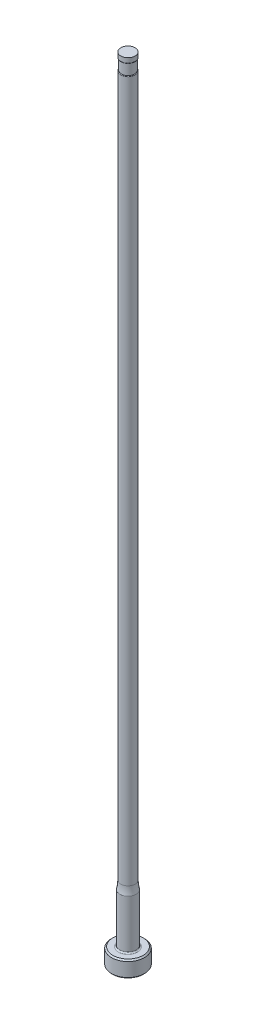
ISO-10303-21;
HEADER;
FILE_DESCRIPTION(('STEP AP214'),'2;1');
FILE_NAME('part.step','',(''),(''),'','','');
FILE_SCHEMA(('AUTOMOTIVE_DESIGN { 1 0 10303 214 1 1 1 1 }'));
ENDSEC;
DATA;
#1=APPLICATION_CONTEXT('core data for automotive mechanical design processes');
#2=APPLICATION_PROTOCOL_DEFINITION('international standard','automotive_design',2000,#1);
#3=PRODUCT_CONTEXT('',#1,'mechanical');
#4=PRODUCT('Part','Part','',(#3));
#5=PRODUCT_RELATED_PRODUCT_CATEGORY('part','',(#4));
#6=PRODUCT_DEFINITION_FORMATION('','',#4);
#7=PRODUCT_DEFINITION_CONTEXT('part definition',#1,'design');
#8=PRODUCT_DEFINITION('design','',#6,#7);
#9=PRODUCT_DEFINITION_SHAPE('','',#8);
#10=(LENGTH_UNIT() NAMED_UNIT(*) SI_UNIT(.MILLI.,.METRE.));
#11=(NAMED_UNIT(*) PLANE_ANGLE_UNIT() SI_UNIT($,.RADIAN.));
#12=(NAMED_UNIT(*) SI_UNIT($,.STERADIAN.) SOLID_ANGLE_UNIT());
#13=UNCERTAINTY_MEASURE_WITH_UNIT(LENGTH_MEASURE(1.E-05),#10,'distance_accuracy_value','');
#14=(GEOMETRIC_REPRESENTATION_CONTEXT(3) GLOBAL_UNCERTAINTY_ASSIGNED_CONTEXT((#13)) GLOBAL_UNIT_ASSIGNED_CONTEXT((#10,
#11,#12)) REPRESENTATION_CONTEXT('',''));
#15=CARTESIAN_POINT('',(0.,0.,0.));
#16=DIRECTION('',(0.,0.,1.));
#17=DIRECTION('',(1.,0.,0.));
#18=AXIS2_PLACEMENT_3D('',#15,#16,#17);
#19=CARTESIAN_POINT('',(0.,259.958771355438,0.));
#20=DIRECTION('',(0.,1.,0.));
#21=DIRECTION('',(0.,0.,1.));
#22=AXIS2_PLACEMENT_3D('',#19,#20,#21);
#23=CYLINDRICAL_SURFACE('',#22,1.38810999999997);
#24=DIRECTION('',(0.,1.,0.));
#25=VECTOR('',#24,1.);
#26=CARTESIAN_POINT('',(-1.28650999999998,259.958771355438,-0.521288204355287));
#27=LINE('',#26,#25);
#28=CARTESIAN_POINT('',(-1.28650999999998,149.227565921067,-0.521288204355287));
#29=VERTEX_POINT('',#28);
#30=CARTESIAN_POINT('',(-1.28650999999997,112.268,-0.521288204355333));
#31=VERTEX_POINT('',#30);
#32=EDGE_CURVE('E66',#29,#31,#27,.F.);
#33=ORIENTED_EDGE('',*,*,#32,.F.);
#34=CARTESIAN_POINT('',(0.,149.227565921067,0.));
#35=DIRECTION('',(0.,1.,0.));
#36=DIRECTION('',(0.,0.,1.));
#37=AXIS2_PLACEMENT_3D('',#34,#35,#36);
#38=CIRCLE('',#37,1.38810999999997);
#39=CARTESIAN_POINT('',(-1.28650999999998,149.227565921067,0.521288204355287));
#40=VERTEX_POINT('',#39);
#41=EDGE_CURVE('E44',#29,#40,#38,.F.);
#42=ORIENTED_EDGE('',*,*,#41,.T.);
#43=DIRECTION('',(0.,1.,0.));
#44=VECTOR('',#43,1.);
#45=CARTESIAN_POINT('',(-1.28650999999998,259.958771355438,0.521288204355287));
#46=LINE('',#45,#44);
#47=CARTESIAN_POINT('',(-1.28650999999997,112.268,0.521288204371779));
#48=VERTEX_POINT('',#47);
#49=EDGE_CURVE('E72',#48,#40,#46,.T.);
#50=ORIENTED_EDGE('',*,*,#49,.F.);
#51=CARTESIAN_POINT('',(-1.28650999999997,112.268,-0.521288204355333));
#52=CARTESIAN_POINT('',(-1.28650942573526,112.242928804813,-0.521284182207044));
#53=CARTESIAN_POINT('',(-1.28680726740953,112.217865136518,-0.520555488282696));
#54=CARTESIAN_POINT('',(-1.28799191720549,112.167826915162,-0.517619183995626));
#55=CARTESIAN_POINT('',(-1.28887900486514,112.142852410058,-0.515410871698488));
#56=CARTESIAN_POINT('',(-1.29243982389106,112.067619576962,-0.506452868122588));
#57=CARTESIAN_POINT('',(-1.29601290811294,112.017650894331,-0.49736839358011));
#58=CARTESIAN_POINT('',(-1.30530992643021,111.919479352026,-0.472434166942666));
#59=CARTESIAN_POINT('',(-1.31103961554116,111.871281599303,-0.456566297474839));
#60=CARTESIAN_POINT('',(-1.32412375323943,111.778513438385,-0.417110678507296));
#61=CARTESIAN_POINT('',(-1.33146964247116,111.733925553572,-0.393563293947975));
#62=CARTESIAN_POINT('',(-1.34350828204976,111.668593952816,-0.349438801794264));
#63=CARTESIAN_POINT('',(-1.34799903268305,111.645780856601,-0.331865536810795));
#64=CARTESIAN_POINT('',(-1.35686421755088,111.60296367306,-0.29352417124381));
#65=CARTESIAN_POINT('',(-1.36123876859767,111.582956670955,-0.272759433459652));
#66=CARTESIAN_POINT('',(-1.36869665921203,111.550112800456,-0.232084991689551));
#67=CARTESIAN_POINT('',(-1.37186978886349,111.536633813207,-0.212714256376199));
#68=CARTESIAN_POINT('',(-1.37757131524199,111.51295318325,-0.171955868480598));
#69=CARTESIAN_POINT('',(-1.38010004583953,111.502749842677,-0.150569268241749));
#70=CARTESIAN_POINT('',(-1.38424028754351,111.486264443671,-0.105984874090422));
#71=CARTESIAN_POINT('',(-1.38584269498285,111.480021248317,-0.0827715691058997));
#72=CARTESIAN_POINT('',(-1.3878558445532,111.472203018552,-0.0355242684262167));
#73=CARTESIAN_POINT('',(-1.38826785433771,111.470623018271,-0.0114911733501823));
#74=CARTESIAN_POINT('',(-1.38787374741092,111.472145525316,0.0326639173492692));
#75=CARTESIAN_POINT('',(-1.38724652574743,111.474560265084,0.0528147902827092));
#76=CARTESIAN_POINT('',(-1.38517272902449,111.482639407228,0.0924056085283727));
#77=CARTESIAN_POINT('',(-1.38372605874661,111.488304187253,0.111845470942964));
#78=CARTESIAN_POINT('',(-1.38015682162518,111.502532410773,0.149590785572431));
#79=CARTESIAN_POINT('',(-1.37803307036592,111.511100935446,0.167894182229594));
#80=CARTESIAN_POINT('',(-1.37329208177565,111.530682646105,0.203060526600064));
#81=CARTESIAN_POINT('',(-1.3706746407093,111.541696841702,0.219922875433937));
#82=CARTESIAN_POINT('',(-1.36363743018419,111.572179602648,0.260714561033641));
#83=CARTESIAN_POINT('',(-1.35900359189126,111.593015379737,0.283587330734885));
#84=CARTESIAN_POINT('',(-1.34954115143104,111.638071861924,0.325660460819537));
#85=CARTESIAN_POINT('',(-1.34471211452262,111.662300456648,0.344852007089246));
#86=CARTESIAN_POINT('',(-1.3331073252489,111.724742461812,0.387781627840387));
#87=CARTESIAN_POINT('',(-1.32644843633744,111.764293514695,0.409600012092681));
#88=CARTESIAN_POINT('',(-1.31433631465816,111.846492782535,0.446935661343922));
#89=CARTESIAN_POINT('',(-1.3088875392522,111.889151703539,0.462429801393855));
#90=CARTESIAN_POINT('',(-1.29848168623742,111.987173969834,0.491004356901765));
#91=CARTESIAN_POINT('',(-1.29398787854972,112.043047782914,0.50251359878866));
#92=CARTESIAN_POINT('',(-1.2895011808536,112.127377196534,0.513856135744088));
#93=CARTESIAN_POINT('',(-1.28838136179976,112.155428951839,0.516650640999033));
#94=CARTESIAN_POINT('',(-1.28688584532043,112.211649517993,0.520362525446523));
#95=CARTESIAN_POINT('',(-1.28650943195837,112.239818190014,0.521281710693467));
#96=CARTESIAN_POINT('',(-1.28650999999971,112.267999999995,0.521288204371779));
#97=B_SPLINE_CURVE_WITH_KNOTS('',3,(#51,#52,#53,#54,#55,#56,#57,#58,#59,#60,#61,#62,#63,#64,#65,
#66,#67,#68,#69,#70,#71,#72,#73,#74,#75,#76,#77,#78,#79,#80,#81,#82,#83,#84,#85,#86,#87,#88,#89,
#90,#91,#92,#93,#94,#95,#96),.UNSPECIFIED.,.F.,.F.,(4,2,2,2,2,2,2,2,2,2,2,2,2,2,2,2,2,2,2,2,2,2,
4),(0.,0.0751855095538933,0.15040671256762,0.30263293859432,0.455268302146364,0.607113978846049,
0.694309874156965,0.781414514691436,0.852578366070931,0.923705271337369,0.99551980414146,
1.06725783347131,1.12787752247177,1.18850425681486,1.2492376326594,1.30999612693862,
1.40332110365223,1.49686681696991,1.63308593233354,1.76979877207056,1.94068119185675,
2.02526314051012,2.10976359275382),.UNSPECIFIED.);
#98=EDGE_CURVE('E74',#31,#48,#97,.T.);
#99=ORIENTED_EDGE('',*,*,#98,.F.);
#100=EDGE_LOOP('',(#33,#42,#50,#99));
#101=FACE_BOUND('',#100,.T.);
#102=CARTESIAN_POINT('',(0.,14.2787642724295,0.));
#103=DIRECTION('',(0.,1.,0.));
#104=DIRECTION('',(0.,0.,1.));
#105=AXIS2_PLACEMENT_3D('',#102,#103,#104);
#106=CIRCLE('',#105,1.38810999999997);
#107=CARTESIAN_POINT('',(0.,14.2787642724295,1.38810999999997));
#108=VERTEX_POINT('',#107);
#109=EDGE_CURVE('E95',#108,#108,#106,.T.);
#110=ORIENTED_EDGE('',*,*,#109,.T.);
#111=EDGE_LOOP('',(#110));
#112=FACE_BOUND('',#111,.T.);
#113=ADVANCED_FACE('F36',(#101,#112),#23,.T.);
#114=CARTESIAN_POINT('',(0.,14.2787642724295,0.));
#115=DIRECTION('',(0.,1.,0.));
#116=DIRECTION('',(0.,0.,1.));
#117=AXIS2_PLACEMENT_3D('',#114,#115,#116);
#118=TOROIDAL_SURFACE('',#117,7.73810999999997,6.35);
#119=CARTESIAN_POINT('',(0.,12.7,0.));
#120=DIRECTION('',(0.,1.,0.));
#121=DIRECTION('',(0.,0.,1.));
#122=AXIS2_PLACEMENT_3D('',#119,#120,#121);
#123=CIRCLE('',#122,1.58749999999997);
#124=CARTESIAN_POINT('',(0.,12.7,1.58749999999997));
#125=VERTEX_POINT('',#124);
#126=EDGE_CURVE('E92',#125,#125,#123,.T.);
#127=ORIENTED_EDGE('',*,*,#126,.T.);
#128=EDGE_LOOP('',(#127));
#129=FACE_BOUND('',#128,.T.);
#130=ORIENTED_EDGE('',*,*,#109,.F.);
#131=EDGE_LOOP('',(#130));
#132=FACE_BOUND('',#131,.T.);
#133=ADVANCED_FACE('F156',(#129,#132),#118,.F.);
#134=CARTESIAN_POINT('',(0.,259.958771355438,0.));
#135=DIRECTION('',(0.,1.,0.));
#136=DIRECTION('',(0.,0.,1.));
#137=AXIS2_PLACEMENT_3D('',#134,#135,#136);
#138=CYLINDRICAL_SURFACE('',#137,1.58749999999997);
#139=CARTESIAN_POINT('',(0.,3.42900000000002,0.));
#140=DIRECTION('',(0.,1.,0.));
#141=DIRECTION('',(0.,0.,1.));
#142=AXIS2_PLACEMENT_3D('',#139,#140,#141);
#143=CIRCLE('',#142,1.58749999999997);
#144=CARTESIAN_POINT('',(0.,3.42900000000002,1.58749999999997));
#145=VERTEX_POINT('',#144);
#146=EDGE_CURVE('E110',#145,#145,#143,.T.);
#147=ORIENTED_EDGE('',*,*,#146,.T.);
#148=EDGE_LOOP('',(#147));
#149=FACE_BOUND('',#148,.T.);
#150=ORIENTED_EDGE('',*,*,#126,.F.);
#151=EDGE_LOOP('',(#150));
#152=FACE_BOUND('',#151,.T.);
#153=ADVANCED_FACE('F153',(#149,#152),#138,.T.);
#154=CARTESIAN_POINT('',(-3.17499999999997,3.175,0.));
#155=DIRECTION('',(0.,1.,0.));
#156=DIRECTION('',(0.,0.,1.));
#157=AXIS2_PLACEMENT_3D('',#154,#155,#156);
#158=PLANE('',#157);
#159=CARTESIAN_POINT('',(0.,3.175,0.));
#160=DIRECTION('',(0.,1.,0.));
#161=DIRECTION('',(0.,0.,1.));
#162=AXIS2_PLACEMENT_3D('',#159,#160,#161);
#163=CIRCLE('',#162,1.84149999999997);
#164=CARTESIAN_POINT('',(0.,3.175,1.84149999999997));
#165=VERTEX_POINT('',#164);
#166=EDGE_CURVE('E78',#165,#165,#163,.F.);
#167=ORIENTED_EDGE('',*,*,#166,.T.);
#168=EDGE_LOOP('',(#167));
#169=FACE_BOUND('',#168,.T.);
#170=CARTESIAN_POINT('',(0.,3.175,0.));
#171=DIRECTION('',(0.,1.,0.));
#172=DIRECTION('',(0.,0.,1.));
#173=AXIS2_PLACEMENT_3D('',#170,#171,#172);
#174=CIRCLE('',#173,2.92099999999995);
#175=CARTESIAN_POINT('',(0.,3.175,2.92099999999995));
#176=VERTEX_POINT('',#175);
#177=EDGE_CURVE('E98',#176,#176,#174,.T.);
#178=ORIENTED_EDGE('',*,*,#177,.T.);
#179=EDGE_LOOP('',(#178));
#180=FACE_BOUND('',#179,.T.);
#181=ADVANCED_FACE('F149',(#169,#180),#158,.T.);
#182=CARTESIAN_POINT('',(0.,259.958771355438,0.));
#183=DIRECTION('',(0.,1.,0.));
#184=DIRECTION('',(0.,0.,1.));
#185=AXIS2_PLACEMENT_3D('',#182,#183,#184);
#186=CYLINDRICAL_SURFACE('',#185,3.17499999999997);
#187=CARTESIAN_POINT('',(0.,2.92100000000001,0.));
#188=DIRECTION('',(0.,1.,0.));
#189=DIRECTION('',(0.,0.,1.));
#190=AXIS2_PLACEMENT_3D('',#187,#188,#189);
#191=CIRCLE('',#190,3.17499999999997);
#192=CARTESIAN_POINT('',(0.,2.92100000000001,3.17499999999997));
#193=VERTEX_POINT('',#192);
#194=EDGE_CURVE('E104',#193,#193,#191,.F.);
#195=ORIENTED_EDGE('',*,*,#194,.T.);
#196=EDGE_LOOP('',(#195));
#197=FACE_BOUND('',#196,.T.);
#198=CARTESIAN_POINT('',(0.,0.254000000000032,0.));
#199=DIRECTION('',(0.,-1.,0.));
#200=DIRECTION('',(0.,0.,-1.));
#201=AXIS2_PLACEMENT_3D('',#198,#199,#200);
#202=CIRCLE('',#201,3.17499999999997);
#203=CARTESIAN_POINT('',(0.,0.254000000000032,-3.17499999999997));
#204=VERTEX_POINT('',#203);
#205=EDGE_CURVE('E101',#204,#204,#202,.F.);
#206=ORIENTED_EDGE('',*,*,#205,.T.);
#207=EDGE_LOOP('',(#206));
#208=FACE_BOUND('',#207,.T.);
#209=ADVANCED_FACE('F145',(#197,#208),#186,.T.);
#210=CARTESIAN_POINT('',(0.,0.,0.));
#211=DIRECTION('',(0.,-1.,0.));
#212=DIRECTION('',(0.,0.,-1.));
#213=AXIS2_PLACEMENT_3D('',#210,#211,#212);
#214=PLANE('',#213);
#215=CARTESIAN_POINT('',(0.,0.,0.));
#216=DIRECTION('',(0.,-1.,0.));
#217=DIRECTION('',(0.,0.,-1.));
#218=AXIS2_PLACEMENT_3D('',#215,#216,#217);
#219=CIRCLE('',#218,2.92099999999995);
#220=CARTESIAN_POINT('',(0.,0.,-2.92099999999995));
#221=VERTEX_POINT('',#220);
#222=EDGE_CURVE('E107',#221,#221,#219,.T.);
#223=ORIENTED_EDGE('',*,*,#222,.T.);
#224=EDGE_LOOP('',(#223));
#225=FACE_BOUND('',#224,.T.);
#226=ADVANCED_FACE('F141',(#225),#214,.T.);
#227=CARTESIAN_POINT('',(0.,3.17499999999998,0.));
#228=DIRECTION('',(0.,-1.,0.));
#229=DIRECTION('',(0.,0.,-1.));
#230=AXIS2_PLACEMENT_3D('',#227,#228,#229);
#231=CONICAL_SURFACE('',#230,2.92099999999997,0.7853981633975);
#232=ORIENTED_EDGE('',*,*,#194,.F.);
#233=EDGE_LOOP('',(#232));
#234=FACE_BOUND('',#233,.T.);
#235=ORIENTED_EDGE('',*,*,#177,.F.);
#236=EDGE_LOOP('',(#235));
#237=FACE_BOUND('',#236,.T.);
#238=ADVANCED_FACE('F144',(#234,#237),#231,.T.);
#239=CARTESIAN_POINT('',(0.,0.254000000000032,0.));
#240=DIRECTION('',(0.,1.,0.));
#241=DIRECTION('',(0.,0.,1.));
#242=AXIS2_PLACEMENT_3D('',#239,#240,#241);
#243=CONICAL_SURFACE('',#242,3.17499999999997,0.785398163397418);
#244=ORIENTED_EDGE('',*,*,#222,.F.);
#245=EDGE_LOOP('',(#244));
#246=FACE_BOUND('',#245,.T.);
#247=ORIENTED_EDGE('',*,*,#205,.F.);
#248=EDGE_LOOP('',(#247));
#249=FACE_BOUND('',#248,.T.);
#250=ADVANCED_FACE('F245',(#246,#249),#243,.T.);
#251=CARTESIAN_POINT('',(0.,3.42900000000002,0.));
#252=DIRECTION('',(0.,1.,0.));
#253=DIRECTION('',(0.,0.,1.));
#254=AXIS2_PLACEMENT_3D('',#251,#252,#253);
#255=TOROIDAL_SURFACE('',#254,1.84149999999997,0.254);
#256=ORIENTED_EDGE('',*,*,#166,.F.);
#257=EDGE_LOOP('',(#256));
#258=FACE_BOUND('',#257,.T.);
#259=ORIENTED_EDGE('',*,*,#146,.F.);
#260=EDGE_LOOP('',(#259));
#261=FACE_BOUND('',#260,.T.);
#262=ADVANCED_FACE('F139',(#258,#261),#255,.F.);
#263=CARTESIAN_POINT('',(0.,153.448281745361,0.));
#264=DIRECTION('',(0.,1.,0.));
#265=DIRECTION('',(0.,0.,1.));
#266=AXIS2_PLACEMENT_3D('',#263,#264,#265);
#267=CYLINDRICAL_SURFACE('',#266,1.28650999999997);
#268=CARTESIAN_POINT('',(0.,151.384,0.));
#269=DIRECTION('',(0.,1.,0.));
#270=DIRECTION('',(0.,0.,1.));
#271=AXIS2_PLACEMENT_3D('',#268,#269,#270);
#272=CIRCLE('',#271,1.28650999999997);
#273=CARTESIAN_POINT('',(0.,151.384,1.28650999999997));
#274=VERTEX_POINT('',#273);
#275=EDGE_CURVE('E71',#274,#274,#272,.T.);
#276=ORIENTED_EDGE('',*,*,#275,.F.);
#277=EDGE_LOOP('',(#276));
#278=FACE_BOUND('',#277,.T.);
#279=CARTESIAN_POINT('',(0.,149.352,0.));
#280=DIRECTION('',(0.,1.,0.));
#281=DIRECTION('',(0.,0.,1.));
#282=AXIS2_PLACEMENT_3D('',#279,#280,#281);
#283=CIRCLE('',#282,1.28650999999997);
#284=CARTESIAN_POINT('',(-1.28650999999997,149.352,0.));
#285=VERTEX_POINT('',#284);
#286=EDGE_CURVE('E89',#285,#285,#283,.T.);
#287=ORIENTED_EDGE('',*,*,#286,.T.);
#288=EDGE_LOOP('',(#287));
#289=FACE_BOUND('',#288,.T.);
#290=ADVANCED_FACE('F136',(#278,#289),#267,.T.);
#291=CARTESIAN_POINT('',(-1.28650999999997,150.368,-3.17499999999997));
#292=DIRECTION('',(1.,0.,0.));
#293=DIRECTION('',(0.,1.,0.));
#294=AXIS2_PLACEMENT_3D('',#291,#292,#293);
#295=PLANE('',#294);
#296=CARTESIAN_POINT('',(-1.28650999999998,149.227565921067,0.521288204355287));
#297=CARTESIAN_POINT('',(-1.28650999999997,149.230543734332,0.521296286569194));
#298=CARTESIAN_POINT('',(-1.28650999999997,149.23351092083,0.52100974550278));
#299=CARTESIAN_POINT('',(-1.28650999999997,149.239314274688,0.519922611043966));
#300=CARTESIAN_POINT('',(-1.28650999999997,149.242151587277,0.519128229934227));
#301=CARTESIAN_POINT('',(-1.28650999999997,149.24828840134,0.516865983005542));
#302=CARTESIAN_POINT('',(-1.28650999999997,149.251545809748,0.515285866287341));
#303=CARTESIAN_POINT('',(-1.28650999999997,149.257773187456,0.511618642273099));
#304=CARTESIAN_POINT('',(-1.28650999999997,149.26074164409,0.509529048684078));
#305=CARTESIAN_POINT('',(-1.28650999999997,149.268061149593,0.503633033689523));
#306=CARTESIAN_POINT('',(-1.28650999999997,149.272183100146,0.499545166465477));
#307=CARTESIAN_POINT('',(-1.28650999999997,149.279782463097,0.490820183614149));
#308=CARTESIAN_POINT('',(-1.28650999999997,149.283258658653,0.486182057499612));
#309=CARTESIAN_POINT('',(-1.28650999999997,149.293007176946,0.471627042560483));
#310=CARTESIAN_POINT('',(-1.28650999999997,149.298482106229,0.461183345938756));
#311=CARTESIAN_POINT('',(-1.28650999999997,149.308043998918,0.439690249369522));
#312=CARTESIAN_POINT('',(-1.28650999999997,149.312126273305,0.428638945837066));
#313=CARTESIAN_POINT('',(-1.28650999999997,149.31962285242,0.405219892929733));
#314=CARTESIAN_POINT('',(-1.28650999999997,149.322944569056,0.392822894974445));
#315=CARTESIAN_POINT('',(-1.28650999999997,149.328742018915,0.367829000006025));
#316=CARTESIAN_POINT('',(-1.28650999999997,149.331216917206,0.355231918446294));
#317=CARTESIAN_POINT('',(-1.28650999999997,149.337717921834,0.317205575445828));
#318=CARTESIAN_POINT('',(-1.28650999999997,149.340799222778,0.291618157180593));
#319=CARTESIAN_POINT('',(-1.28650999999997,149.34553097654,0.240181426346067));
#320=CARTESIAN_POINT('',(-1.28650999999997,149.347172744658,0.214331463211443));
#321=CARTESIAN_POINT('',(-1.28650999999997,149.349602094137,0.162584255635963));
#322=CARTESIAN_POINT('',(-1.28650999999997,149.350389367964,0.136686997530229));
#323=CARTESIAN_POINT('',(-1.28650999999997,149.351321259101,0.0922416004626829));
#324=CARTESIAN_POINT('',(-1.28650999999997,149.351584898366,0.0736953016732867));
#325=CARTESIAN_POINT('',(-1.28650999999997,149.351919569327,0.0367659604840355));
#326=CARTESIAN_POINT('',(-1.28650999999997,149.351992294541,0.0183829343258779));
#327=CARTESIAN_POINT('',(-1.28650999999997,149.352,0.));
#328=B_SPLINE_CURVE_WITH_KNOTS('',3,(#296,#297,#298,#299,#300,#301,#302,#303,#304,#305,#306,
#307,#308,#309,#310,#311,#312,#313,#314,#315,#316,#317,#318,#319,#320,#321,#322,#323,#324,#325,
#326,#327),.UNSPECIFIED.,.F.,.F.,(4,2,2,2,2,2,2,2,2,2,2,2,2,2,2,4),(0.,0.00890253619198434,
0.0176982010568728,0.0284990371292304,0.039353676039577,0.0566710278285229,0.0740206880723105,
0.109198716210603,0.144494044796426,0.182950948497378,0.221445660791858,0.298673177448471,
0.376363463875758,0.454081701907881,0.509725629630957,0.564874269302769),.UNSPECIFIED.);
#329=EDGE_CURVE('E77',#40,#285,#328,.T.);
#330=ORIENTED_EDGE('',*,*,#329,.T.);
#331=CARTESIAN_POINT('',(-1.28650999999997,149.352,0.));
#332=CARTESIAN_POINT('',(-1.28650999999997,149.351985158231,-0.0211574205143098));
#333=CARTESIAN_POINT('',(-1.28650999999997,149.351892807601,-0.0423161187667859));
#334=CARTESIAN_POINT('',(-1.28650999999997,149.351447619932,-0.0846465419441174));
#335=CARTESIAN_POINT('',(-1.28650999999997,149.351094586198,-0.105818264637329));
#336=CARTESIAN_POINT('',(-1.28650999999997,149.350021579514,-0.148180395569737));
#337=CARTESIAN_POINT('',(-1.28650999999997,149.349301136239,-0.169370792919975));
#338=CARTESIAN_POINT('',(-1.28650999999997,149.347275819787,-0.211719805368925));
#339=CARTESIAN_POINT('',(-1.28650999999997,149.345971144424,-0.23287842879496));
#340=CARTESIAN_POINT('',(-1.28650999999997,149.342936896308,-0.2692392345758));
#341=CARTESIAN_POINT('',(-1.28650999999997,149.341426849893,-0.284459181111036));
#342=CARTESIAN_POINT('',(-1.28650999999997,149.337747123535,-0.314836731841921));
#343=CARTESIAN_POINT('',(-1.28650999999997,149.335576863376,-0.329994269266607));
#344=CARTESIAN_POINT('',(-1.28650999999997,149.330226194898,-0.360706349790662));
#345=CARTESIAN_POINT('',(-1.28650999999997,149.327011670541,-0.376255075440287));
#346=CARTESIAN_POINT('',(-1.28650999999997,149.319175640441,-0.406994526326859));
#347=CARTESIAN_POINT('',(-1.28650999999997,149.314556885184,-0.422185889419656));
#348=CARTESIAN_POINT('',(-1.28650999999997,149.306067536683,-0.444158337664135));
#349=CARTESIAN_POINT('',(-1.28650999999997,149.303027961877,-0.451257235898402));
#350=CARTESIAN_POINT('',(-1.28650999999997,149.296272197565,-0.465143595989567));
#351=CARTESIAN_POINT('',(-1.28650999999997,149.292555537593,-0.471930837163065));
#352=CARTESIAN_POINT('',(-1.28650999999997,149.285166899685,-0.483496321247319));
#353=CARTESIAN_POINT('',(-1.28650999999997,149.281669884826,-0.488384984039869));
#354=CARTESIAN_POINT('',(-1.28650999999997,149.274009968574,-0.49761163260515));
#355=CARTESIAN_POINT('',(-1.28650999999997,149.26984924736,-0.501951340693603));
#356=CARTESIAN_POINT('',(-1.28650999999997,149.262744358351,-0.50799036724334));
#357=CARTESIAN_POINT('',(-1.28650999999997,149.260073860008,-0.510009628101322));
#358=CARTESIAN_POINT('',(-1.28650999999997,149.254472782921,-0.513654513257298));
#359=CARTESIAN_POINT('',(-1.28650999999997,149.251542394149,-0.515280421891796));
#360=CARTESIAN_POINT('',(-1.28650999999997,149.245862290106,-0.517827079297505));
#361=CARTESIAN_POINT('',(-1.28650999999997,149.243142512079,-0.518813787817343));
#362=CARTESIAN_POINT('',(-1.28650999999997,149.237578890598,-0.520316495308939));
#363=CARTESIAN_POINT('',(-1.28650999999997,149.234735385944,-0.520833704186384));
#364=CARTESIAN_POINT('',(-1.28650999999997,149.230439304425,-0.521223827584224));
#365=CARTESIAN_POINT('',(-1.28650999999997,149.229002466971,-0.52128961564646));
#366=CARTESIAN_POINT('',(-1.28650999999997,149.227565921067,-0.521288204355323));
#367=B_SPLINE_CURVE_WITH_KNOTS('',3,(#331,#332,#333,#334,#335,#336,#337,#338,#339,#340,#341,
#342,#343,#344,#345,#346,#347,#348,#349,#350,#351,#352,#353,#354,#355,#356,#357,#358,#359,#360,
#361,#362,#363,#364,#365,#366),.UNSPECIFIED.,.F.,.F.,(4,2,2,2,2,2,2,2,2,2,2,2,2,2,2,2,2,4),(0.,
0.0634741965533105,0.126996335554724,0.190599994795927,0.254182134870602,0.300056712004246,
0.345971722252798,0.393570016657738,0.44107567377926,0.464219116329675,0.487378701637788,
0.505372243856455,0.523307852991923,0.533326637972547,0.543338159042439,0.551983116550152,
0.56060573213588,0.564915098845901),.UNSPECIFIED.);
#368=EDGE_CURVE('E58',#285,#29,#367,.T.);
#369=ORIENTED_EDGE('',*,*,#368,.T.);
#370=ORIENTED_EDGE('',*,*,#32,.T.);
#371=DIRECTION('',(0.,0.,1.));
#372=VECTOR('',#371,1.);
#373=CARTESIAN_POINT('',(-1.28650999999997,112.268,-3.17499999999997));
#374=LINE('',#373,#372);
#375=EDGE_CURVE('E70',#31,#48,#374,.T.);
#376=ORIENTED_EDGE('',*,*,#375,.T.);
#377=ORIENTED_EDGE('',*,*,#49,.T.);
#378=EDGE_LOOP('',(#330,#369,#370,#376,#377));
#379=FACE_BOUND('',#378,.T.);
#380=ADVANCED_FACE('F68',(#379),#295,.F.);
#381=CARTESIAN_POINT('',(-4.46150999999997,112.268,-3.17499999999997));
#382=DIRECTION('',(0.,0.,1.));
#383=DIRECTION('',(1.,0.,0.));
#384=AXIS2_PLACEMENT_3D('',#381,#382,#383);
#385=CYLINDRICAL_SURFACE('',#384,3.175);
#386=ORIENTED_EDGE('',*,*,#375,.F.);
#387=ORIENTED_EDGE('',*,*,#98,.T.);
#388=EDGE_LOOP('',(#386,#387));
#389=FACE_BOUND('',#388,.T.);
#390=ADVANCED_FACE('F80',(#389),#385,.F.);
#391=CARTESIAN_POINT('',(0.,152.687735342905,0.));
#392=DIRECTION('',(0.,1.,0.));
#393=DIRECTION('',(0.,0.,1.));
#394=AXIS2_PLACEMENT_3D('',#391,#392,#393);
#395=CYLINDRICAL_SURFACE('',#394,1.38302999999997);
#396=CARTESIAN_POINT('',(0.,151.507288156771,0.));
#397=DIRECTION('',(0.,-1.,0.));
#398=DIRECTION('',(0.,0.,-1.));
#399=AXIS2_PLACEMENT_3D('',#396,#397,#398);
#400=CIRCLE('',#399,1.38302999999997);
#401=CARTESIAN_POINT('',(0.,151.507288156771,-1.38302999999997));
#402=VERTEX_POINT('',#401);
#403=EDGE_CURVE('E11',#402,#402,#400,.F.);
#404=ORIENTED_EDGE('',*,*,#403,.T.);
#405=EDGE_LOOP('',(#404));
#406=FACE_BOUND('',#405,.T.);
#407=CARTESIAN_POINT('',(0.,152.4,0.));
#408=DIRECTION('',(0.,1.,0.));
#409=DIRECTION('',(0.,0.,1.));
#410=AXIS2_PLACEMENT_3D('',#407,#408,#409);
#411=CIRCLE('',#410,1.38302999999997);
#412=CARTESIAN_POINT('',(0.,152.4,1.38302999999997));
#413=VERTEX_POINT('',#412);
#414=EDGE_CURVE('E81',#413,#413,#411,.T.);
#415=ORIENTED_EDGE('',*,*,#414,.F.);
#416=EDGE_LOOP('',(#415));
#417=FACE_BOUND('',#416,.T.);
#418=ADVANCED_FACE('F133',(#406,#417),#395,.T.);
#419=CARTESIAN_POINT('',(-1.38810999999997,152.4,0.));
#420=DIRECTION('',(0.,1.,0.));
#421=DIRECTION('',(0.,0.,1.));
#422=AXIS2_PLACEMENT_3D('',#419,#420,#421);
#423=PLANE('',#422);
#424=ORIENTED_EDGE('',*,*,#414,.T.);
#425=EDGE_LOOP('',(#424));
#426=FACE_BOUND('',#425,.T.);
#427=ADVANCED_FACE('F177',(#426),#423,.T.);
#428=CARTESIAN_POINT('',(0.,149.227565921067,0.));
#429=DIRECTION('',(0.,1.,0.));
#430=DIRECTION('',(0.,0.,1.));
#431=AXIS2_PLACEMENT_3D('',#428,#429,#430);
#432=TOROIDAL_SURFACE('',#431,1.26110999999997,0.127);
#433=ORIENTED_EDGE('',*,*,#329,.F.);
#434=ORIENTED_EDGE('',*,*,#41,.F.);
#435=ORIENTED_EDGE('',*,*,#368,.F.);
#436=ORIENTED_EDGE('',*,*,#286,.F.);
#437=EDGE_LOOP('',(#433,#434,#435,#436));
#438=FACE_BOUND('',#437,.T.);
#439=ADVANCED_FACE('F209',(#438),#432,.T.);
#440=CARTESIAN_POINT('',(0.,151.507288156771,0.));
#441=DIRECTION('',(0.,-1.,0.));
#442=DIRECTION('',(0.,0.,-1.));
#443=AXIS2_PLACEMENT_3D('',#440,#441,#442);
#444=TOROIDAL_SURFACE('',#443,1.25602999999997,0.127);
#445=ORIENTED_EDGE('',*,*,#275,.T.);
#446=EDGE_LOOP('',(#445));
#447=FACE_BOUND('',#446,.T.);
#448=ORIENTED_EDGE('',*,*,#403,.F.);
#449=EDGE_LOOP('',(#448));
#450=FACE_BOUND('',#449,.T.);
#451=ADVANCED_FACE('F38',(#447,#450),#444,.T.);
#452=CLOSED_SHELL('',(#113,#133,#153,#181,#209,#226,#238,#250,#262,#290,#380,#390,#418,#427,
#439,#451));
#453=MANIFOLD_SOLID_BREP('B2',#452);
#454=ADVANCED_BREP_SHAPE_REPRESENTATION('',(#18,#453),#14);
#455=SHAPE_DEFINITION_REPRESENTATION(#9,#454);
ENDSEC;
END-ISO-10303-21;
